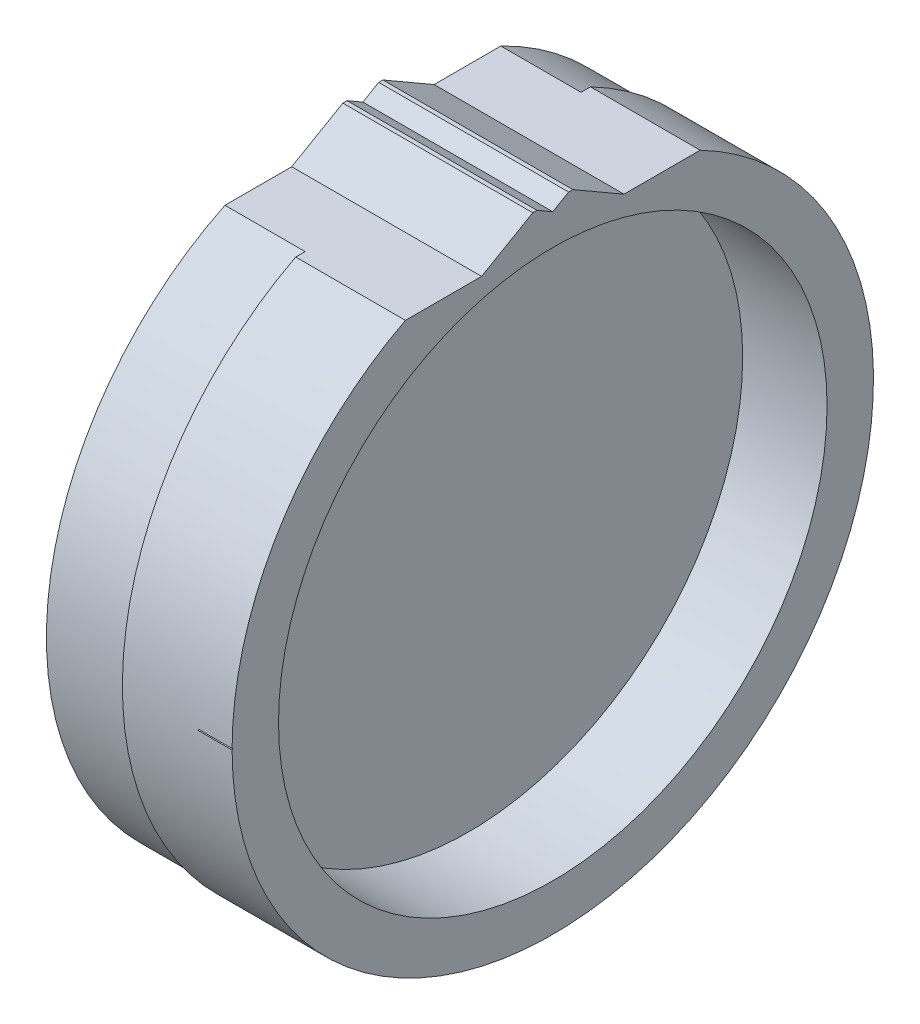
ISO-10303-21;
HEADER;
FILE_DESCRIPTION(('STEP AP214'),'2;1');
FILE_NAME('part.step','',(''),(''),'','','');
FILE_SCHEMA(('AUTOMOTIVE_DESIGN { 1 0 10303 214 1 1 1 1 }'));
ENDSEC;
DATA;
#1=APPLICATION_CONTEXT('core data for automotive mechanical design processes');
#2=APPLICATION_PROTOCOL_DEFINITION('international standard','automotive_design',2000,#1);
#3=PRODUCT_CONTEXT('',#1,'mechanical');
#4=PRODUCT('Part','Part','',(#3));
#5=PRODUCT_RELATED_PRODUCT_CATEGORY('part','',(#4));
#6=PRODUCT_DEFINITION_FORMATION('','',#4);
#7=PRODUCT_DEFINITION_CONTEXT('part definition',#1,'design');
#8=PRODUCT_DEFINITION('design','',#6,#7);
#9=PRODUCT_DEFINITION_SHAPE('','',#8);
#10=(LENGTH_UNIT() NAMED_UNIT(*) SI_UNIT(.MILLI.,.METRE.));
#11=(NAMED_UNIT(*) PLANE_ANGLE_UNIT() SI_UNIT($,.RADIAN.));
#12=(NAMED_UNIT(*) SI_UNIT($,.STERADIAN.) SOLID_ANGLE_UNIT());
#13=UNCERTAINTY_MEASURE_WITH_UNIT(LENGTH_MEASURE(1.E-05),#10,'distance_accuracy_value','');
#14=(GEOMETRIC_REPRESENTATION_CONTEXT(3) GLOBAL_UNCERTAINTY_ASSIGNED_CONTEXT((#13)) GLOBAL_UNIT_ASSIGNED_CONTEXT((#10,
#11,#12)) REPRESENTATION_CONTEXT('',''));
#15=CARTESIAN_POINT('',(0.,0.,0.));
#16=DIRECTION('',(0.,0.,1.));
#17=DIRECTION('',(1.,0.,0.));
#18=AXIS2_PLACEMENT_3D('',#15,#16,#17);
#19=CARTESIAN_POINT('',(-46.,74.5,-25.));
#20=DIRECTION('',(0.,-1.,0.));
#21=DIRECTION('',(0.,0.,-1.));
#22=AXIS2_PLACEMENT_3D('',#19,#20,#21);
#23=PLANE('',#22);
#24=DIRECTION('',(0.,0.,1.));
#25=VECTOR('',#24,1.);
#26=CARTESIAN_POINT('',(-45.,74.5,0.));
#27=LINE('',#26,#25);
#28=CARTESIAN_POINT('',(-45.,74.5,3.75));
#29=VERTEX_POINT('',#28);
#30=CARTESIAN_POINT('',(-45.,74.5,4.75));
#31=VERTEX_POINT('',#30);
#32=EDGE_CURVE('E175',#29,#31,#27,.T.);
#33=ORIENTED_EDGE('',*,*,#32,.T.);
#34=DIRECTION('',(-1.,0.,0.));
#35=VECTOR('',#34,1.);
#36=CARTESIAN_POINT('',(0.001000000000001,74.5,4.75));
#37=LINE('',#36,#35);
#38=CARTESIAN_POINT('',(0.,74.5,4.75));
#39=VERTEX_POINT('',#38);
#40=EDGE_CURVE('E44',#39,#31,#37,.T.);
#41=ORIENTED_EDGE('',*,*,#40,.F.);
#42=DIRECTION('',(0.,0.,-1.));
#43=VECTOR('',#42,1.);
#44=CARTESIAN_POINT('',(0.,74.5,0.));
#45=LINE('',#44,#43);
#46=CARTESIAN_POINT('',(0.,74.5,3.75));
#47=VERTEX_POINT('',#46);
#48=EDGE_CURVE('E171',#39,#47,#45,.T.);
#49=ORIENTED_EDGE('',*,*,#48,.T.);
#50=DIRECTION('',(-1.,0.,0.));
#51=VECTOR('',#50,1.);
#52=CARTESIAN_POINT('',(0.001000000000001,74.5,3.75));
#53=LINE('',#52,#51);
#54=EDGE_CURVE('E464',#47,#29,#53,.T.);
#55=ORIENTED_EDGE('',*,*,#54,.T.);
#56=EDGE_LOOP('',(#33,#41,#49,#55));
#57=FACE_BOUND('',#56,.T.);
#58=ADVANCED_FACE('F17',(#57),#23,.F.);
#59=CARTESIAN_POINT('',(0.,0.,0.));
#60=DIRECTION('',(1.,0.,0.));
#61=DIRECTION('',(0.,0.,-1.));
#62=AXIS2_PLACEMENT_3D('',#59,#60,#61);
#63=CYLINDRICAL_SURFACE('',#62,75.);
#64=DIRECTION('',(1.,0.,0.));
#65=VECTOR('',#64,1.);
#66=CARTESIAN_POINT('',(0.,67.5,-32.6917420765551));
#67=LINE('',#66,#65);
#68=CARTESIAN_POINT('',(-45.,67.5,-32.6917420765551));
#69=VERTEX_POINT('',#68);
#70=CARTESIAN_POINT('',(-26.,67.5,-32.6917420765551));
#71=VERTEX_POINT('',#70);
#72=EDGE_CURVE('E165',#69,#71,#67,.T.);
#73=ORIENTED_EDGE('',*,*,#72,.T.);
#74=CARTESIAN_POINT('',(-26.,0.,0.));
#75=DIRECTION('',(1.,0.,0.));
#76=DIRECTION('',(0.,0.,-1.));
#77=AXIS2_PLACEMENT_3D('',#74,#75,#76);
#78=CIRCLE('',#77,75.);
#79=CARTESIAN_POINT('',(-26.,67.5,32.6917420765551));
#80=VERTEX_POINT('',#79);
#81=EDGE_CURVE('E259',#80,#71,#78,.T.);
#82=ORIENTED_EDGE('',*,*,#81,.F.);
#83=DIRECTION('',(1.,0.,0.));
#84=VECTOR('',#83,1.);
#85=CARTESIAN_POINT('',(0.,67.5,32.6917420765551));
#86=LINE('',#85,#84);
#87=CARTESIAN_POINT('',(-45.,67.5,32.6917420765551));
#88=VERTEX_POINT('',#87);
#89=EDGE_CURVE('E439',#80,#88,#86,.F.);
#90=ORIENTED_EDGE('',*,*,#89,.T.);
#91=CARTESIAN_POINT('',(-45.,0.,0.));
#92=DIRECTION('',(1.,0.,0.));
#93=DIRECTION('',(0.,0.,-1.));
#94=AXIS2_PLACEMENT_3D('',#91,#92,#93);
#95=CIRCLE('',#94,75.);
#96=EDGE_CURVE('E256',#88,#69,#95,.T.);
#97=ORIENTED_EDGE('',*,*,#96,.T.);
#98=EDGE_LOOP('',(#73,#82,#90,#97));
#99=FACE_BOUND('',#98,.T.);
#100=CARTESIAN_POINT('',(-37.,-74.7596147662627,-6.));
#101=CARTESIAN_POINT('',(-37.1682816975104,-74.7596144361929,-6.00000148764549));
#102=CARTESIAN_POINT('',(-37.3365401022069,-74.7601841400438,-5.99291755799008));
#103=CARTESIAN_POINT('',(-37.6719130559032,-74.7624461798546,-5.96463328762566));
#104=CARTESIAN_POINT('',(-37.8390273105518,-74.7641387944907,-5.94342944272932));
#105=CARTESIAN_POINT('',(-38.1710030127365,-74.7686008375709,-5.88703031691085));
#106=CARTESIAN_POINT('',(-38.3358624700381,-74.7713711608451,-5.85182340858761));
#107=CARTESIAN_POINT('',(-38.6620778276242,-74.7779105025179,-5.76765824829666));
#108=CARTESIAN_POINT('',(-38.8234324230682,-74.7816798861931,-5.71869496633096));
#109=CARTESIAN_POINT('',(-39.141280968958,-74.7901053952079,-5.60742739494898));
#110=CARTESIAN_POINT('',(-39.2977793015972,-74.7947606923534,-5.54513555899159));
#111=CARTESIAN_POINT('',(-39.6050236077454,-74.8048298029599,-5.40760490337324));
#112=CARTESIAN_POINT('',(-39.7557674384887,-74.8102438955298,-5.33236131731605));
#113=CARTESIAN_POINT('',(-40.0502920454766,-74.8216722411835,-5.16952771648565));
#114=CARTESIAN_POINT('',(-40.1940768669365,-74.8276861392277,-5.08194499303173));
#115=CARTESIAN_POINT('',(-40.4738199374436,-74.8401489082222,-4.89498600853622));
#116=CARTESIAN_POINT('',(-40.6097752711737,-74.8465979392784,-4.79560539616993));
#117=CARTESIAN_POINT('',(-40.8730759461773,-74.8597581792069,-4.5855958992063));
#118=CARTESIAN_POINT('',(-41.0004059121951,-74.866469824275,-4.47494776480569));
#119=CARTESIAN_POINT('',(-41.2453444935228,-74.8799571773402,-4.24328601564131));
#120=CARTESIAN_POINT('',(-41.3629494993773,-74.8867329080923,-4.12226858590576));
#121=CARTESIAN_POINT('',(-41.5875190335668,-74.9001519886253,-3.87079797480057));
#122=CARTESIAN_POINT('',(-41.6944870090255,-74.9067953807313,-3.74034787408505));
#123=CARTESIAN_POINT('',(-41.897106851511,-74.9197665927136,-3.47084670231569));
#124=CARTESIAN_POINT('',(-41.992754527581,-74.9260942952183,-3.33179247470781));
#125=CARTESIAN_POINT('',(-42.1720950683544,-74.9382582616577,-3.04596831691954));
#126=CARTESIAN_POINT('',(-42.2557763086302,-74.9440940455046,-2.89919107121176));
#127=CARTESIAN_POINT('',(-42.4105042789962,-74.9551038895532,-2.59903213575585));
#128=CARTESIAN_POINT('',(-42.481546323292,-74.9602777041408,-2.44564802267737));
#129=CARTESIAN_POINT('',(-42.6104226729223,-74.9698119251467,-2.1334592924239));
#130=CARTESIAN_POINT('',(-42.6682620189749,-74.9741726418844,-1.97465677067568));
#131=CARTESIAN_POINT('',(-42.7703669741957,-74.9819617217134,-1.65270684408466));
#132=CARTESIAN_POINT('',(-42.8146275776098,-74.9853897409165,-1.48955786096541));
#133=CARTESIAN_POINT('',(-42.9262914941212,-74.9941004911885,-0.996156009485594));
#134=CARTESIAN_POINT('',(-42.9729980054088,-74.9978421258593,-0.660925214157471));
#135=CARTESIAN_POINT('',(-43.0094677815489,-75.0007561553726,0.0124549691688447));
#136=CARTESIAN_POINT('',(-42.9992320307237,-74.9999286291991,0.350604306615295));
#137=CARTESIAN_POINT('',(-42.9222803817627,-74.9938127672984,1.0196302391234));
#138=CARTESIAN_POINT('',(-42.8556937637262,-74.9885346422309,1.35052170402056));
#139=CARTESIAN_POINT('',(-42.6681116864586,-74.9741210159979,1.9964034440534));
#140=CARTESIAN_POINT('',(-42.5471157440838,-74.9649854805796,2.3113935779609));
#141=CARTESIAN_POINT('',(-42.2540104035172,-74.9438679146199,2.91695932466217));
#142=CARTESIAN_POINT('',(-42.0818429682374,-74.9318826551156,3.20750673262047));
#143=CARTESIAN_POINT('',(-41.6913225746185,-74.9064127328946,3.75562727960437));
#144=CARTESIAN_POINT('',(-41.4729687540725,-74.8929280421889,4.01319980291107));
#145=CARTESIAN_POINT('',(-40.9955451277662,-74.8659305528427,4.48881604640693));
#146=CARTESIAN_POINT('',(-40.7363629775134,-74.8524177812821,4.70674701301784));
#147=CARTESIAN_POINT('',(-40.1850317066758,-74.8269251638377,5.09602278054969));
#148=CARTESIAN_POINT('',(-39.892882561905,-74.8149453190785,5.26736754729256));
#149=CARTESIAN_POINT('',(-39.28383254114,-74.7938725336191,5.55860218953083));
#150=CARTESIAN_POINT('',(-38.9669289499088,-74.7847799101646,5.67848641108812));
#151=CARTESIAN_POINT('',(-38.317402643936,-74.7705170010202,5.86331440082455));
#152=CARTESIAN_POINT('',(-37.9847802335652,-74.7653466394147,5.92825923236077));
#153=CARTESIAN_POINT('',(-37.3142443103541,-74.7595257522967,6.00122257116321));
#154=CARTESIAN_POINT('',(-36.9763480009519,-74.7588627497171,6.00939822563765));
#155=CARTESIAN_POINT('',(-36.3039895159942,-74.7620987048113,5.96900258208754));
#156=CARTESIAN_POINT('',(-35.9695273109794,-74.7659976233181,5.92043177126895));
#157=CARTESIAN_POINT('',(-35.3139811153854,-74.7779067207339,5.76805289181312));
#158=CARTESIAN_POINT('',(-34.992880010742,-74.7859114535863,5.66431798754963));
#159=CARTESIAN_POINT('',(-34.372641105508,-74.8051256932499,5.40462981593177));
#160=CARTESIAN_POINT('',(-34.0735036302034,-74.8163352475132,5.24867577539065));
#161=CARTESIAN_POINT('',(-33.5049637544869,-74.8407263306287,4.88857826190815));
#162=CARTESIAN_POINT('',(-33.2356279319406,-74.85391212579,4.68432996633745));
#163=CARTESIAN_POINT('',(-32.7350094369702,-74.880755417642,4.23359219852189));
#164=CARTESIAN_POINT('',(-32.5037273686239,-74.8944129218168,3.98710205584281));
#165=CARTESIAN_POINT('',(-32.0852457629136,-74.9206978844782,3.45820343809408));
#166=CARTESIAN_POINT('',(-31.8981482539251,-74.9333229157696,3.1757141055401));
#167=CARTESIAN_POINT('',(-31.5740482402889,-74.9560851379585,2.58322271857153));
#168=CARTESIAN_POINT('',(-31.4370452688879,-74.9662223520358,2.27322092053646));
#169=CARTESIAN_POINT('',(-31.2171924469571,-74.9828567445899,1.63493442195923));
#170=CARTESIAN_POINT('',(-31.1342792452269,-74.9893581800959,1.30667160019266));
#171=CARTESIAN_POINT('',(-31.0247767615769,-74.9980011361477,0.640645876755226));
#172=CARTESIAN_POINT('',(-30.9981865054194,-75.0001427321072,0.302883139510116));
#173=CARTESIAN_POINT('',(-31.0010527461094,-74.9999169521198,-0.202703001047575));
#174=CARTESIAN_POINT('',(-31.0091081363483,-74.9992706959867,-0.370910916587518));
#175=CARTESIAN_POINT('',(-31.039314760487,-74.9968632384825,-0.706031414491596));
#176=CARTESIAN_POINT('',(-31.0614607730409,-74.9951024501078,-0.872944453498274));
#177=CARTESIAN_POINT('',(-31.1197055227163,-74.9905129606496,-1.20435424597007));
#178=CARTESIAN_POINT('',(-31.1558093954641,-74.9876838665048,-1.36885008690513));
#179=CARTESIAN_POINT('',(-31.2416898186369,-74.9810396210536,-1.69415097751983));
#180=CARTESIAN_POINT('',(-31.2914613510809,-74.9772248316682,-1.85495735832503));
#181=CARTESIAN_POINT('',(-31.4043438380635,-74.9687148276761,-2.17185027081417));
#182=CARTESIAN_POINT('',(-31.4674590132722,-74.9640193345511,-2.32793529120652));
#183=CARTESIAN_POINT('',(-31.6065418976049,-74.9538830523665,-2.63417554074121));
#184=CARTESIAN_POINT('',(-31.6825048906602,-74.9484425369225,-2.78433292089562));
#185=CARTESIAN_POINT('',(-31.8467876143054,-74.9369660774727,-3.07777289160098));
#186=CARTESIAN_POINT('',(-31.9351116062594,-74.9309299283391,-3.22105308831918));
#187=CARTESIAN_POINT('',(-32.1234362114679,-74.9184360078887,-3.49962608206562));
#188=CARTESIAN_POINT('',(-32.2234325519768,-74.9119783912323,-3.63492177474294));
#189=CARTESIAN_POINT('',(-32.4347432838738,-74.8988011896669,-3.89703159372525));
#190=CARTESIAN_POINT('',(-32.5460910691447,-74.8920808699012,-4.0238187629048));
#191=CARTESIAN_POINT('',(-32.7790215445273,-74.8785893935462,-4.26752183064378));
#192=CARTESIAN_POINT('',(-32.900600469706,-74.8718182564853,-4.3844413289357));
#193=CARTESIAN_POINT('',(-33.1532490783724,-74.8584101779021,-4.60770485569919));
#194=CARTESIAN_POINT('',(-33.2843245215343,-74.8517733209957,-4.71404237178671));
#195=CARTESIAN_POINT('',(-33.5549257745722,-74.838828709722,-4.91527035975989));
#196=CARTESIAN_POINT('',(-33.6944484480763,-74.8325208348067,-5.01016504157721));
#197=CARTESIAN_POINT('',(-33.9813102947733,-74.8203977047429,-5.1880687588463));
#198=CARTESIAN_POINT('',(-34.1286654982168,-74.8145835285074,-5.27105202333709));
#199=CARTESIAN_POINT('',(-34.4298168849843,-74.803630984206,-5.42426873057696));
#200=CARTESIAN_POINT('',(-34.5836106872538,-74.7984923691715,-5.49450683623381));
#201=CARTESIAN_POINT('',(-34.8964682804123,-74.7890394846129,-5.6217116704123));
#202=CARTESIAN_POINT('',(-35.0555274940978,-74.7847245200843,-5.67868959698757));
#203=CARTESIAN_POINT('',(-35.3778512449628,-74.7770379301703,-5.77902451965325));
#204=CARTESIAN_POINT('',(-35.5411147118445,-74.7736660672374,-5.82238494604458));
#205=CARTESIAN_POINT('',(-35.918170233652,-74.7671411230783,-5.90566315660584));
#206=CARTESIAN_POINT('',(-36.1329941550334,-74.7643296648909,-5.94100693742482));
#207=CARTESIAN_POINT('',(-36.5652250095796,-74.7605667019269,-5.98817436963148));
#208=CARTESIAN_POINT('',(-36.7826319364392,-74.7596151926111,-5.99999807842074));
#209=CARTESIAN_POINT('',(-37.,-74.7596147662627,-6.));
#210=B_SPLINE_CURVE_WITH_KNOTS('',3,(#100,#101,#102,#103,#104,#105,#106,#107,#108,#109,#110,
#111,#112,#113,#114,#115,#116,#117,#118,#119,#120,#121,#122,#123,#124,#125,#126,#127,#128,#129,
#130,#131,#132,#133,#134,#135,#136,#137,#138,#139,#140,#141,#142,#143,#144,#145,#146,#147,#148,
#149,#150,#151,#152,#153,#154,#155,#156,#157,#158,#159,#160,#161,#162,#163,#164,#165,#166,#167,
#168,#169,#170,#171,#172,#173,#174,#175,#176,#177,#178,#179,#180,#181,#182,#183,#184,#185,#186,
#187,#188,#189,#190,#191,#192,#193,#194,#195,#196,#197,#198,#199,#200,#201,#202,#203,#204,#205,
#206,#207,#208,#209),.UNSPECIFIED.,.T.,.F.,(4,2,2,2,2,2,2,2,2,2,2,2,2,2,2,2,2,2,2,2,2,2,2,2,2,2,
2,2,2,2,2,2,2,2,2,2,2,2,2,2,2,2,2,2,2,2,2,2,2,2,2,2,2,2,4),(0.,0.504655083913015,
1.00943545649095,1.51463584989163,2.02002121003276,2.52493641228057,3.03003782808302,
3.53484201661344,4.03983297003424,4.54570162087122,5.05175719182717,5.55764822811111,
6.06372597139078,6.57029203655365,7.0770455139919,7.58360519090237,8.09035138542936,
9.10056555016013,10.1107622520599,11.1186476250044,12.1265419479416,13.1355837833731,
14.1446444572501,15.1565318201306,16.1684199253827,17.1804191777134,18.192398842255,
19.2015760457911,20.2107445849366,21.2185779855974,22.2264263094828,23.2364825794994,
24.2465548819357,25.2589372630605,26.2713102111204,27.2824953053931,28.2936629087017,
28.7983777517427,29.3029056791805,29.8076194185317,30.312148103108,30.8168366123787,
31.321340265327,31.826018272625,32.330512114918,32.8365354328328,33.3423733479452,
33.8485206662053,34.3544811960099,34.8615204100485,35.3683737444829,35.8747974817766,
36.3810935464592,37.0329538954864,37.6848126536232),.UNSPECIFIED.);
#211=CARTESIAN_POINT('',(-37.,-74.7596147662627,-6.));
#212=VERTEX_POINT('',#211);
#213=EDGE_CURVE('E11',#212,#212,#210,.T.);
#214=ORIENTED_EDGE('',*,*,#213,.T.);
#215=EDGE_LOOP('',(#214));
#216=FACE_BOUND('',#215,.T.);
#217=ADVANCED_FACE('F285',(#99,#216),#63,.T.);
#218=CARTESIAN_POINT('',(-20.,0.,0.));
#219=DIRECTION('',(1.,0.,0.));
#220=DIRECTION('',(0.,0.,-1.));
#221=AXIS2_PLACEMENT_3D('',#218,#219,#220);
#222=PLANE('',#221);
#223=CARTESIAN_POINT('',(-20.,0.,0.));
#224=DIRECTION('',(1.,0.,0.));
#225=DIRECTION('',(0.,0.,-1.));
#226=AXIS2_PLACEMENT_3D('',#223,#224,#225);
#227=CIRCLE('',#226,65.);
#228=CARTESIAN_POINT('',(-20.,0.,-65.));
#229=VERTEX_POINT('',#228);
#230=EDGE_CURVE('E29',#229,#229,#227,.T.);
#231=ORIENTED_EDGE('',*,*,#230,.T.);
#232=EDGE_LOOP('',(#231));
#233=FACE_BOUND('',#232,.T.);
#234=ADVANCED_FACE('F19',(#233),#222,.T.);
#235=CARTESIAN_POINT('',(0.,0.,0.));
#236=DIRECTION('',(1.,0.,0.));
#237=DIRECTION('',(0.,0.,-1.));
#238=AXIS2_PLACEMENT_3D('',#235,#236,#237);
#239=CYLINDRICAL_SURFACE('',#238,65.);
#240=CARTESIAN_POINT('',(0.,0.,0.));
#241=DIRECTION('',(1.,0.,0.));
#242=DIRECTION('',(0.,0.,-1.));
#243=AXIS2_PLACEMENT_3D('',#240,#241,#242);
#244=CIRCLE('',#243,65.);
#245=CARTESIAN_POINT('',(0.,0.,-65.));
#246=VERTEX_POINT('',#245);
#247=EDGE_CURVE('E268',#246,#246,#244,.T.);
#248=ORIENTED_EDGE('',*,*,#247,.T.);
#249=EDGE_LOOP('',(#248));
#250=FACE_BOUND('',#249,.T.);
#251=ORIENTED_EDGE('',*,*,#230,.F.);
#252=EDGE_LOOP('',(#251));
#253=FACE_BOUND('',#252,.T.);
#254=ADVANCED_FACE('F274',(#250,#253),#239,.F.);
#255=CARTESIAN_POINT('',(0.,65.,0.));
#256=DIRECTION('',(1.,0.,0.));
#257=DIRECTION('',(0.,0.,-1.));
#258=AXIS2_PLACEMENT_3D('',#255,#256,#257);
#259=PLANE('',#258);
#260=DIRECTION('',(0.,0.5,0.866025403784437));
#261=VECTOR('',#260,1.);
#262=CARTESIAN_POINT('',(0.,74.5,-4.75));
#263=LINE('',#262,#261);
#264=CARTESIAN_POINT('',(0.,67.5,-16.874355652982));
#265=VERTEX_POINT('',#264);
#266=CARTESIAN_POINT('',(0.,74.5,-4.75));
#267=VERTEX_POINT('',#266);
#268=EDGE_CURVE('E147',#265,#267,#263,.T.);
#269=ORIENTED_EDGE('',*,*,#268,.T.);
#270=CARTESIAN_POINT('',(0.,74.5,-3.75));
#271=VERTEX_POINT('',#270);
#272=EDGE_CURVE('E161',#271,#267,#45,.T.);
#273=ORIENTED_EDGE('',*,*,#272,.F.);
#274=DIRECTION('',(0.,-0.5,0.866025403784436));
#275=VECTOR('',#274,1.);
#276=CARTESIAN_POINT('',(0.,74.5,-3.75));
#277=LINE('',#276,#275);
#278=CARTESIAN_POINT('',(0.,72.3349364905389,0.));
#279=VERTEX_POINT('',#278);
#280=EDGE_CURVE('E467',#271,#279,#277,.T.);
#281=ORIENTED_EDGE('',*,*,#280,.T.);
#282=DIRECTION('',(0.,0.5,0.86602540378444));
#283=VECTOR('',#282,1.);
#284=CARTESIAN_POINT('',(0.,72.3349364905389,0.));
#285=LINE('',#284,#283);
#286=EDGE_CURVE('E456',#279,#47,#285,.T.);
#287=ORIENTED_EDGE('',*,*,#286,.T.);
#288=ORIENTED_EDGE('',*,*,#48,.F.);
#289=DIRECTION('',(0.,-0.5,0.866025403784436));
#290=VECTOR('',#289,1.);
#291=CARTESIAN_POINT('',(0.,74.5,4.75));
#292=LINE('',#291,#290);
#293=CARTESIAN_POINT('',(0.,67.5,16.874355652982));
#294=VERTEX_POINT('',#293);
#295=EDGE_CURVE('E435',#39,#294,#292,.T.);
#296=ORIENTED_EDGE('',*,*,#295,.T.);
#297=DIRECTION('',(0.,0.,1.));
#298=VECTOR('',#297,1.);
#299=CARTESIAN_POINT('',(0.,67.5,16.874355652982));
#300=LINE('',#299,#298);
#301=CARTESIAN_POINT('',(0.,67.5,34.9249194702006));
#302=VERTEX_POINT('',#301);
#303=EDGE_CURVE('E433',#294,#302,#300,.T.);
#304=ORIENTED_EDGE('',*,*,#303,.T.);
#305=CARTESIAN_POINT('',(0.,0.,0.));
#306=DIRECTION('',(1.,0.,0.));
#307=DIRECTION('',(0.,0.,-1.));
#308=AXIS2_PLACEMENT_3D('',#305,#306,#307);
#309=CIRCLE('',#308,76.);
#310=CARTESIAN_POINT('',(0.,0.15,75.9998519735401));
#311=VERTEX_POINT('',#310);
#312=EDGE_CURVE('E265',#302,#311,#309,.T.);
#313=ORIENTED_EDGE('',*,*,#312,.T.);
#314=DIRECTION('',(0.,0.499999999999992,0.866025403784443));
#315=VECTOR('',#314,1.);
#316=CARTESIAN_POINT('',(0.,0.15,75.9998519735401));
#317=LINE('',#316,#315);
#318=CARTESIAN_POINT('',(0.,0.,75.7400443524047));
#319=VERTEX_POINT('',#318);
#320=EDGE_CURVE('E181',#319,#311,#317,.T.);
#321=ORIENTED_EDGE('',*,*,#320,.F.);
#322=DIRECTION('',(0.,0.499999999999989,-0.866025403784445));
#323=VECTOR('',#322,1.);
#324=CARTESIAN_POINT('',(0.,0.,75.7400443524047));
#325=LINE('',#324,#323);
#326=CARTESIAN_POINT('',(0.,-0.15,75.9998519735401));
#327=VERTEX_POINT('',#326);
#328=EDGE_CURVE('E174',#327,#319,#325,.T.);
#329=ORIENTED_EDGE('',*,*,#328,.F.);
#330=CARTESIAN_POINT('',(0.,67.5,-34.9249194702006));
#331=VERTEX_POINT('',#330);
#332=EDGE_CURVE('E266',#327,#331,#309,.T.);
#333=ORIENTED_EDGE('',*,*,#332,.T.);
#334=DIRECTION('',(0.,0.,1.));
#335=VECTOR('',#334,1.);
#336=CARTESIAN_POINT('',(0.,67.5,-16.874355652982));
#337=LINE('',#336,#335);
#338=EDGE_CURVE('E163',#331,#265,#337,.T.);
#339=ORIENTED_EDGE('',*,*,#338,.T.);
#340=EDGE_LOOP('',(#269,#273,#281,#287,#288,#296,#304,#313,#321,#329,#333,#339));
#341=FACE_BOUND('',#340,.T.);
#342=ORIENTED_EDGE('',*,*,#247,.F.);
#343=EDGE_LOOP('',(#342));
#344=FACE_BOUND('',#343,.T.);
#345=ADVANCED_FACE('F158',(#341,#344),#259,.T.);
#346=CARTESIAN_POINT('',(0.,0.,0.));
#347=DIRECTION('',(1.,0.,0.));
#348=DIRECTION('',(0.,0.,-1.));
#349=AXIS2_PLACEMENT_3D('',#346,#347,#348);
#350=CYLINDRICAL_SURFACE('',#349,76.);
#351=DIRECTION('',(-1.,0.,0.));
#352=VECTOR('',#351,1.);
#353=CARTESIAN_POINT('',(0.001000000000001,67.5,-34.9249194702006));
#354=LINE('',#353,#352);
#355=CARTESIAN_POINT('',(-26.,67.5,-34.9249194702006));
#356=VERTEX_POINT('',#355);
#357=EDGE_CURVE('E417',#331,#356,#354,.T.);
#358=ORIENTED_EDGE('',*,*,#357,.F.);
#359=ORIENTED_EDGE('',*,*,#332,.F.);
#360=DIRECTION('',(1.,0.,0.));
#361=VECTOR('',#360,1.);
#362=CARTESIAN_POINT('',(-8.,-0.15,75.9998519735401));
#363=LINE('',#362,#361);
#364=CARTESIAN_POINT('',(-8.,-0.15,75.9998519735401));
#365=VERTEX_POINT('',#364);
#366=EDGE_CURVE('E192',#365,#327,#363,.T.);
#367=ORIENTED_EDGE('',*,*,#366,.F.);
#368=CARTESIAN_POINT('',(-8.,0.,0.));
#369=DIRECTION('',(1.,0.,0.));
#370=DIRECTION('',(0.,0.,-1.));
#371=AXIS2_PLACEMENT_3D('',#368,#369,#370);
#372=CIRCLE('',#371,76.);
#373=CARTESIAN_POINT('',(-8.,0.15,75.9998519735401));
#374=VERTEX_POINT('',#373);
#375=EDGE_CURVE('E184',#374,#365,#372,.T.);
#376=ORIENTED_EDGE('',*,*,#375,.F.);
#377=DIRECTION('',(1.,0.,0.));
#378=VECTOR('',#377,1.);
#379=CARTESIAN_POINT('',(-8.,0.15,75.9998519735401));
#380=LINE('',#379,#378);
#381=EDGE_CURVE('E193',#374,#311,#380,.T.);
#382=ORIENTED_EDGE('',*,*,#381,.T.);
#383=ORIENTED_EDGE('',*,*,#312,.F.);
#384=DIRECTION('',(-1.,0.,0.));
#385=VECTOR('',#384,1.);
#386=CARTESIAN_POINT('',(0.001000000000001,67.5,34.9249194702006));
#387=LINE('',#386,#385);
#388=CARTESIAN_POINT('',(-26.,67.5,34.9249194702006));
#389=VERTEX_POINT('',#388);
#390=EDGE_CURVE('E430',#302,#389,#387,.T.);
#391=ORIENTED_EDGE('',*,*,#390,.T.);
#392=CARTESIAN_POINT('',(-26.,0.,0.));
#393=DIRECTION('',(1.,0.,0.));
#394=DIRECTION('',(0.,0.,-1.));
#395=AXIS2_PLACEMENT_3D('',#392,#393,#394);
#396=CIRCLE('',#395,76.);
#397=EDGE_CURVE('E262',#389,#356,#396,.T.);
#398=ORIENTED_EDGE('',*,*,#397,.T.);
#399=EDGE_LOOP('',(#358,#359,#367,#376,#382,#383,#391,#398));
#400=FACE_BOUND('',#399,.T.);
#401=ADVANCED_FACE('F283',(#400),#350,.T.);
#402=CARTESIAN_POINT('',(-26.,76.,0.));
#403=DIRECTION('',(-1.,0.,0.));
#404=DIRECTION('',(0.,0.,1.));
#405=AXIS2_PLACEMENT_3D('',#402,#403,#404);
#406=PLANE('',#405);
#407=DIRECTION('',(0.,0.,-1.));
#408=VECTOR('',#407,1.);
#409=CARTESIAN_POINT('',(-26.,67.5,-16.874355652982));
#410=LINE('',#409,#408);
#411=EDGE_CURVE('E152',#71,#356,#410,.T.);
#412=ORIENTED_EDGE('',*,*,#411,.T.);
#413=ORIENTED_EDGE('',*,*,#397,.F.);
#414=DIRECTION('',(0.,0.,-1.));
#415=VECTOR('',#414,1.);
#416=CARTESIAN_POINT('',(-26.,67.5,16.874355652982));
#417=LINE('',#416,#415);
#418=EDGE_CURVE('E453',#389,#80,#417,.T.);
#419=ORIENTED_EDGE('',*,*,#418,.T.);
#420=ORIENTED_EDGE('',*,*,#81,.T.);
#421=EDGE_LOOP('',(#412,#413,#419,#420));
#422=FACE_BOUND('',#421,.T.);
#423=ADVANCED_FACE('F403',(#422),#406,.T.);
#424=CARTESIAN_POINT('',(-45.,75.,0.));
#425=DIRECTION('',(-1.,0.,0.));
#426=DIRECTION('',(0.,0.,1.));
#427=AXIS2_PLACEMENT_3D('',#424,#425,#426);
#428=PLANE('',#427);
#429=DIRECTION('',(0.,0.5,0.866025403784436));
#430=VECTOR('',#429,1.);
#431=CARTESIAN_POINT('',(-45.,74.5,-4.75));
#432=LINE('',#431,#430);
#433=CARTESIAN_POINT('',(-45.,67.5,-16.874355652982));
#434=VERTEX_POINT('',#433);
#435=CARTESIAN_POINT('',(-45.,74.5,-4.75));
#436=VERTEX_POINT('',#435);
#437=EDGE_CURVE('E36',#434,#436,#432,.T.);
#438=ORIENTED_EDGE('',*,*,#437,.F.);
#439=DIRECTION('',(0.,0.,1.));
#440=VECTOR('',#439,1.);
#441=CARTESIAN_POINT('',(-45.,67.5,-16.874355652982));
#442=LINE('',#441,#440);
#443=EDGE_CURVE('E164',#69,#434,#442,.T.);
#444=ORIENTED_EDGE('',*,*,#443,.F.);
#445=ORIENTED_EDGE('',*,*,#96,.F.);
#446=DIRECTION('',(0.,0.,1.));
#447=VECTOR('',#446,1.);
#448=CARTESIAN_POINT('',(-45.,67.5,16.874355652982));
#449=LINE('',#448,#447);
#450=CARTESIAN_POINT('',(-45.,67.5,16.874355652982));
#451=VERTEX_POINT('',#450);
#452=EDGE_CURVE('E441',#451,#88,#449,.T.);
#453=ORIENTED_EDGE('',*,*,#452,.F.);
#454=DIRECTION('',(0.,-0.5,0.866025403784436));
#455=VECTOR('',#454,1.);
#456=CARTESIAN_POINT('',(-45.,74.5,4.75));
#457=LINE('',#456,#455);
#458=EDGE_CURVE('E438',#31,#451,#457,.T.);
#459=ORIENTED_EDGE('',*,*,#458,.F.);
#460=ORIENTED_EDGE('',*,*,#32,.F.);
#461=DIRECTION('',(0.,0.5,0.86602540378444));
#462=VECTOR('',#461,1.);
#463=CARTESIAN_POINT('',(-45.,72.3349364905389,0.));
#464=LINE('',#463,#462);
#465=CARTESIAN_POINT('',(-45.,72.3349364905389,0.));
#466=VERTEX_POINT('',#465);
#467=EDGE_CURVE('E462',#466,#29,#464,.T.);
#468=ORIENTED_EDGE('',*,*,#467,.F.);
#469=DIRECTION('',(0.,-0.5,0.866025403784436));
#470=VECTOR('',#469,1.);
#471=CARTESIAN_POINT('',(-45.,74.5,-3.75));
#472=LINE('',#471,#470);
#473=CARTESIAN_POINT('',(-45.,74.5,-3.75));
#474=VERTEX_POINT('',#473);
#475=EDGE_CURVE('E459',#474,#466,#472,.T.);
#476=ORIENTED_EDGE('',*,*,#475,.F.);
#477=EDGE_CURVE('E172',#436,#474,#27,.T.);
#478=ORIENTED_EDGE('',*,*,#477,.F.);
#479=EDGE_LOOP('',(#438,#444,#445,#453,#459,#460,#468,#476,#478));
#480=FACE_BOUND('',#479,.T.);
#481=CARTESIAN_POINT('',(-45.,54.1265877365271,-31.2500000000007));
#482=DIRECTION('',(-1.,0.,0.));
#483=DIRECTION('',(0.,0.,1.));
#484=AXIS2_PLACEMENT_3D('',#481,#482,#483);
#485=CIRCLE('',#484,4.25);
#486=CARTESIAN_POINT('',(-45.,54.1265877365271,-27.0000000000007));
#487=VERTEX_POINT('',#486);
#488=EDGE_CURVE('E211',#487,#487,#485,.T.);
#489=ORIENTED_EDGE('',*,*,#488,.F.);
#490=EDGE_LOOP('',(#489));
#491=FACE_BOUND('',#490,.T.);
#492=CARTESIAN_POINT('',(-45.,54.1265877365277,31.2499999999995));
#493=DIRECTION('',(-1.,0.,0.));
#494=DIRECTION('',(0.,0.,1.));
#495=AXIS2_PLACEMENT_3D('',#492,#493,#494);
#496=CIRCLE('',#495,4.25);
#497=CARTESIAN_POINT('',(-45.,54.1265877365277,35.4999999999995));
#498=VERTEX_POINT('',#497);
#499=EDGE_CURVE('E217',#498,#498,#496,.T.);
#500=ORIENTED_EDGE('',*,*,#499,.F.);
#501=EDGE_LOOP('',(#500));
#502=FACE_BOUND('',#501,.T.);
#503=CARTESIAN_POINT('',(-45.,4.36435420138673E-13,62.5));
#504=DIRECTION('',(-1.,0.,0.));
#505=DIRECTION('',(0.,0.,1.));
#506=AXIS2_PLACEMENT_3D('',#503,#504,#505);
#507=CIRCLE('',#506,4.25);
#508=CARTESIAN_POINT('',(-45.,4.36435420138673E-13,66.75));
#509=VERTEX_POINT('',#508);
#510=EDGE_CURVE('E223',#509,#509,#507,.T.);
#511=ORIENTED_EDGE('',*,*,#510,.F.);
#512=EDGE_LOOP('',(#511));
#513=FACE_BOUND('',#512,.T.);
#514=CARTESIAN_POINT('',(-45.,-54.1265877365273,31.25));
#515=DIRECTION('',(-1.,0.,0.));
#516=DIRECTION('',(0.,0.,1.));
#517=AXIS2_PLACEMENT_3D('',#514,#515,#516);
#518=CIRCLE('',#517,4.25);
#519=CARTESIAN_POINT('',(-45.,-54.1265877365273,35.5));
#520=VERTEX_POINT('',#519);
#521=EDGE_CURVE('E229',#520,#520,#518,.T.);
#522=ORIENTED_EDGE('',*,*,#521,.F.);
#523=EDGE_LOOP('',(#522));
#524=FACE_BOUND('',#523,.T.);
#525=CARTESIAN_POINT('',(-45.,-54.1265877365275,-31.25));
#526=DIRECTION('',(-1.,0.,0.));
#527=DIRECTION('',(0.,0.,1.));
#528=AXIS2_PLACEMENT_3D('',#525,#526,#527);
#529=CIRCLE('',#528,4.25);
#530=CARTESIAN_POINT('',(-45.,-54.1265877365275,-27.));
#531=VERTEX_POINT('',#530);
#532=EDGE_CURVE('E235',#531,#531,#529,.T.);
#533=ORIENTED_EDGE('',*,*,#532,.F.);
#534=EDGE_LOOP('',(#533));
#535=FACE_BOUND('',#534,.T.);
#536=CARTESIAN_POINT('',(-45.,0.,-62.5));
#537=DIRECTION('',(-1.,0.,0.));
#538=DIRECTION('',(0.,0.,1.));
#539=AXIS2_PLACEMENT_3D('',#536,#537,#538);
#540=CIRCLE('',#539,4.25);
#541=CARTESIAN_POINT('',(-45.,0.,-58.25));
#542=VERTEX_POINT('',#541);
#543=EDGE_CURVE('E241',#542,#542,#540,.T.);
#544=ORIENTED_EDGE('',*,*,#543,.F.);
#545=EDGE_LOOP('',(#544));
#546=FACE_BOUND('',#545,.T.);
#547=CARTESIAN_POINT('',(-45.,62.5,0.));
#548=DIRECTION('',(-1.,0.,0.));
#549=DIRECTION('',(0.,0.,1.));
#550=AXIS2_PLACEMENT_3D('',#547,#548,#549);
#551=CIRCLE('',#550,5.);
#552=CARTESIAN_POINT('',(-45.,62.5,5.));
#553=VERTEX_POINT('',#552);
#554=EDGE_CURVE('E244',#553,#553,#551,.T.);
#555=ORIENTED_EDGE('',*,*,#554,.F.);
#556=EDGE_LOOP('',(#555));
#557=FACE_BOUND('',#556,.T.);
#558=CARTESIAN_POINT('',(-45.,0.,0.));
#559=DIRECTION('',(1.,0.,0.));
#560=DIRECTION('',(0.,0.,-1.));
#561=AXIS2_PLACEMENT_3D('',#558,#559,#560);
#562=CIRCLE('',#561,40.);
#563=CARTESIAN_POINT('',(-45.,0.,-40.));
#564=VERTEX_POINT('',#563);
#565=EDGE_CURVE('E253',#564,#564,#562,.T.);
#566=ORIENTED_EDGE('',*,*,#565,.T.);
#567=EDGE_LOOP('',(#566));
#568=FACE_BOUND('',#567,.T.);
#569=ADVANCED_FACE('F400',(#480,#491,#502,#513,#524,#535,#546,#557,#568),#428,.T.);
#570=CARTESIAN_POINT('',(0.,0.,0.));
#571=DIRECTION('',(1.,0.,0.));
#572=DIRECTION('',(0.,0.,-1.));
#573=AXIS2_PLACEMENT_3D('',#570,#571,#572);
#574=CYLINDRICAL_SURFACE('',#573,40.);
#575=CARTESIAN_POINT('',(-36.5,0.,0.));
#576=DIRECTION('',(1.,0.,0.));
#577=DIRECTION('',(0.,0.,-1.));
#578=AXIS2_PLACEMENT_3D('',#575,#576,#577);
#579=CIRCLE('',#578,40.);
#580=CARTESIAN_POINT('',(-36.5,0.,-40.));
#581=VERTEX_POINT('',#580);
#582=EDGE_CURVE('E250',#581,#581,#579,.T.);
#583=ORIENTED_EDGE('',*,*,#582,.T.);
#584=EDGE_LOOP('',(#583));
#585=FACE_BOUND('',#584,.T.);
#586=ORIENTED_EDGE('',*,*,#565,.F.);
#587=EDGE_LOOP('',(#586));
#588=FACE_BOUND('',#587,.T.);
#589=ADVANCED_FACE('F396',(#585,#588),#574,.F.);
#590=CARTESIAN_POINT('',(-36.5,40.,0.));
#591=DIRECTION('',(-1.,0.,0.));
#592=DIRECTION('',(0.,0.,1.));
#593=AXIS2_PLACEMENT_3D('',#590,#591,#592);
#594=PLANE('',#593);
#595=ORIENTED_EDGE('',*,*,#582,.F.);
#596=EDGE_LOOP('',(#595));
#597=FACE_BOUND('',#596,.T.);
#598=ADVANCED_FACE('F392',(#597),#594,.T.);
#599=CARTESIAN_POINT('',(-30.,62.5,0.));
#600=DIRECTION('',(-1.,0.,0.));
#601=DIRECTION('',(0.,0.,1.));
#602=AXIS2_PLACEMENT_3D('',#599,#600,#601);
#603=CONICAL_SURFACE('',#602,5.,1.02974425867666);
#604=CARTESIAN_POINT('',(-26.9956969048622,62.5,0.));
#605=VERTEX_POINT('',#604);
#606=VERTEX_LOOP('',#605);
#607=FACE_BOUND('',#606,.T.);
#608=CARTESIAN_POINT('',(-30.,62.5,0.));
#609=DIRECTION('',(-1.,0.,0.));
#610=DIRECTION('',(0.,0.,1.));
#611=AXIS2_PLACEMENT_3D('',#608,#609,#610);
#612=CIRCLE('',#611,5.);
#613=CARTESIAN_POINT('',(-30.,62.5,5.));
#614=VERTEX_POINT('',#613);
#615=EDGE_CURVE('E247',#614,#614,#612,.T.);
#616=ORIENTED_EDGE('',*,*,#615,.T.);
#617=EDGE_LOOP('',(#616));
#618=FACE_BOUND('',#617,.T.);
#619=ADVANCED_FACE('F388',(#607,#618),#603,.F.);
#620=CARTESIAN_POINT('',(-45.,62.5,0.));
#621=DIRECTION('',(-1.,0.,0.));
#622=DIRECTION('',(0.,0.,1.));
#623=AXIS2_PLACEMENT_3D('',#620,#621,#622);
#624=CYLINDRICAL_SURFACE('',#623,5.);
#625=ORIENTED_EDGE('',*,*,#615,.F.);
#626=EDGE_LOOP('',(#625));
#627=FACE_BOUND('',#626,.T.);
#628=ORIENTED_EDGE('',*,*,#554,.T.);
#629=EDGE_LOOP('',(#628));
#630=FACE_BOUND('',#629,.T.);
#631=ADVANCED_FACE('F384',(#627,#630),#624,.F.);
#632=CARTESIAN_POINT('',(-45.,0.,-62.5));
#633=DIRECTION('',(-1.,0.,0.));
#634=DIRECTION('',(0.,0.,1.));
#635=AXIS2_PLACEMENT_3D('',#632,#633,#634);
#636=CYLINDRICAL_SURFACE('',#635,4.25);
#637=CARTESIAN_POINT('',(-24.,0.,-62.5));
#638=DIRECTION('',(-1.,0.,0.));
#639=DIRECTION('',(0.,0.,1.));
#640=AXIS2_PLACEMENT_3D('',#637,#638,#639);
#641=CIRCLE('',#640,4.25);
#642=CARTESIAN_POINT('',(-24.,0.,-58.25));
#643=VERTEX_POINT('',#642);
#644=EDGE_CURVE('E238',#643,#643,#641,.T.);
#645=ORIENTED_EDGE('',*,*,#644,.F.);
#646=EDGE_LOOP('',(#645));
#647=FACE_BOUND('',#646,.T.);
#648=ORIENTED_EDGE('',*,*,#543,.T.);
#649=EDGE_LOOP('',(#648));
#650=FACE_BOUND('',#649,.T.);
#651=ADVANCED_FACE('F380',(#647,#650),#636,.F.);
#652=CARTESIAN_POINT('',(-24.,0.,-62.5));
#653=DIRECTION('',(-1.,0.,0.));
#654=DIRECTION('',(0.,0.,1.));
#655=AXIS2_PLACEMENT_3D('',#652,#653,#654);
#656=CONICAL_SURFACE('',#655,4.25,1.02974425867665);
#657=CARTESIAN_POINT('',(-21.4463423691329,0.,-62.5));
#658=VERTEX_POINT('',#657);
#659=VERTEX_LOOP('',#658);
#660=FACE_BOUND('',#659,.T.);
#661=ORIENTED_EDGE('',*,*,#644,.T.);
#662=EDGE_LOOP('',(#661));
#663=FACE_BOUND('',#662,.T.);
#664=ADVANCED_FACE('F376',(#660,#663),#656,.F.);
#665=CARTESIAN_POINT('',(-45.,-54.1265877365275,-31.25));
#666=DIRECTION('',(-1.,0.,0.));
#667=DIRECTION('',(0.,0.,1.));
#668=AXIS2_PLACEMENT_3D('',#665,#666,#667);
#669=CYLINDRICAL_SURFACE('',#668,4.25);
#670=CARTESIAN_POINT('',(-24.,-54.1265877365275,-31.25));
#671=DIRECTION('',(-1.,0.,0.));
#672=DIRECTION('',(0.,0.,1.));
#673=AXIS2_PLACEMENT_3D('',#670,#671,#672);
#674=CIRCLE('',#673,4.25);
#675=CARTESIAN_POINT('',(-24.,-54.1265877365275,-27.));
#676=VERTEX_POINT('',#675);
#677=EDGE_CURVE('E232',#676,#676,#674,.T.);
#678=ORIENTED_EDGE('',*,*,#677,.F.);
#679=EDGE_LOOP('',(#678));
#680=FACE_BOUND('',#679,.T.);
#681=ORIENTED_EDGE('',*,*,#532,.T.);
#682=EDGE_LOOP('',(#681));
#683=FACE_BOUND('',#682,.T.);
#684=ADVANCED_FACE('F372',(#680,#683),#669,.F.);
#685=CARTESIAN_POINT('',(-24.,-54.1265877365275,-31.25));
#686=DIRECTION('',(-1.,0.,0.));
#687=DIRECTION('',(0.,0.,1.));
#688=AXIS2_PLACEMENT_3D('',#685,#686,#687);
#689=CONICAL_SURFACE('',#688,4.25,1.02974425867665);
#690=CARTESIAN_POINT('',(-21.4463423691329,-54.1265877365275,-31.25));
#691=VERTEX_POINT('',#690);
#692=VERTEX_LOOP('',#691);
#693=FACE_BOUND('',#692,.T.);
#694=ORIENTED_EDGE('',*,*,#677,.T.);
#695=EDGE_LOOP('',(#694));
#696=FACE_BOUND('',#695,.T.);
#697=ADVANCED_FACE('F368',(#693,#696),#689,.F.);
#698=CARTESIAN_POINT('',(-45.,-54.1265877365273,31.25));
#699=DIRECTION('',(-1.,0.,0.));
#700=DIRECTION('',(0.,0.,1.));
#701=AXIS2_PLACEMENT_3D('',#698,#699,#700);
#702=CYLINDRICAL_SURFACE('',#701,4.25);
#703=CARTESIAN_POINT('',(-24.,-54.1265877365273,31.25));
#704=DIRECTION('',(-1.,0.,0.));
#705=DIRECTION('',(0.,0.,1.));
#706=AXIS2_PLACEMENT_3D('',#703,#704,#705);
#707=CIRCLE('',#706,4.25);
#708=CARTESIAN_POINT('',(-24.,-54.1265877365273,35.5));
#709=VERTEX_POINT('',#708);
#710=EDGE_CURVE('E226',#709,#709,#707,.T.);
#711=ORIENTED_EDGE('',*,*,#710,.F.);
#712=EDGE_LOOP('',(#711));
#713=FACE_BOUND('',#712,.T.);
#714=ORIENTED_EDGE('',*,*,#521,.T.);
#715=EDGE_LOOP('',(#714));
#716=FACE_BOUND('',#715,.T.);
#717=ADVANCED_FACE('F364',(#713,#716),#702,.F.);
#718=CARTESIAN_POINT('',(-24.,-54.1265877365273,31.25));
#719=DIRECTION('',(-1.,0.,0.));
#720=DIRECTION('',(0.,0.,1.));
#721=AXIS2_PLACEMENT_3D('',#718,#719,#720);
#722=CONICAL_SURFACE('',#721,4.25,1.02974425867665);
#723=CARTESIAN_POINT('',(-21.4463423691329,-54.1265877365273,31.25));
#724=VERTEX_POINT('',#723);
#725=VERTEX_LOOP('',#724);
#726=FACE_BOUND('',#725,.T.);
#727=ORIENTED_EDGE('',*,*,#710,.T.);
#728=EDGE_LOOP('',(#727));
#729=FACE_BOUND('',#728,.T.);
#730=ADVANCED_FACE('F360',(#726,#729),#722,.F.);
#731=CARTESIAN_POINT('',(-45.,4.36435420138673E-13,62.5));
#732=DIRECTION('',(-1.,0.,0.));
#733=DIRECTION('',(0.,0.,1.));
#734=AXIS2_PLACEMENT_3D('',#731,#732,#733);
#735=CYLINDRICAL_SURFACE('',#734,4.25);
#736=CARTESIAN_POINT('',(-24.,4.36435420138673E-13,62.5));
#737=DIRECTION('',(-1.,0.,0.));
#738=DIRECTION('',(0.,0.,1.));
#739=AXIS2_PLACEMENT_3D('',#736,#737,#738);
#740=CIRCLE('',#739,4.25);
#741=CARTESIAN_POINT('',(-24.,4.36435420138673E-13,66.75));
#742=VERTEX_POINT('',#741);
#743=EDGE_CURVE('E220',#742,#742,#740,.T.);
#744=ORIENTED_EDGE('',*,*,#743,.F.);
#745=EDGE_LOOP('',(#744));
#746=FACE_BOUND('',#745,.T.);
#747=ORIENTED_EDGE('',*,*,#510,.T.);
#748=EDGE_LOOP('',(#747));
#749=FACE_BOUND('',#748,.T.);
#750=ADVANCED_FACE('F356',(#746,#749),#735,.F.);
#751=CARTESIAN_POINT('',(-24.,4.36435420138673E-13,62.5));
#752=DIRECTION('',(-1.,0.,0.));
#753=DIRECTION('',(0.,0.,1.));
#754=AXIS2_PLACEMENT_3D('',#751,#752,#753);
#755=CONICAL_SURFACE('',#754,4.25,1.02974425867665);
#756=CARTESIAN_POINT('',(-21.4463423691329,4.3066662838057E-13,62.5));
#757=VERTEX_POINT('',#756);
#758=VERTEX_LOOP('',#757);
#759=FACE_BOUND('',#758,.T.);
#760=ORIENTED_EDGE('',*,*,#743,.T.);
#761=EDGE_LOOP('',(#760));
#762=FACE_BOUND('',#761,.T.);
#763=ADVANCED_FACE('F352',(#759,#762),#755,.F.);
#764=CARTESIAN_POINT('',(-45.,54.1265877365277,31.2499999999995));
#765=DIRECTION('',(-1.,0.,0.));
#766=DIRECTION('',(0.,0.,1.));
#767=AXIS2_PLACEMENT_3D('',#764,#765,#766);
#768=CYLINDRICAL_SURFACE('',#767,4.25);
#769=CARTESIAN_POINT('',(-24.,54.1265877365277,31.2499999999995));
#770=DIRECTION('',(-1.,0.,0.));
#771=DIRECTION('',(0.,0.,1.));
#772=AXIS2_PLACEMENT_3D('',#769,#770,#771);
#773=CIRCLE('',#772,4.25);
#774=CARTESIAN_POINT('',(-24.,54.1265877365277,35.4999999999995));
#775=VERTEX_POINT('',#774);
#776=EDGE_CURVE('E214',#775,#775,#773,.T.);
#777=ORIENTED_EDGE('',*,*,#776,.F.);
#778=EDGE_LOOP('',(#777));
#779=FACE_BOUND('',#778,.T.);
#780=ORIENTED_EDGE('',*,*,#499,.T.);
#781=EDGE_LOOP('',(#780));
#782=FACE_BOUND('',#781,.T.);
#783=ADVANCED_FACE('F348',(#779,#782),#768,.F.);
#784=CARTESIAN_POINT('',(-24.,54.1265877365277,31.2499999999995));
#785=DIRECTION('',(-1.,0.,0.));
#786=DIRECTION('',(0.,0.,1.));
#787=AXIS2_PLACEMENT_3D('',#784,#785,#786);
#788=CONICAL_SURFACE('',#787,4.25,1.02974425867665);
#789=CARTESIAN_POINT('',(-21.4463423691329,54.1265877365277,31.2499999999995));
#790=VERTEX_POINT('',#789);
#791=VERTEX_LOOP('',#790);
#792=FACE_BOUND('',#791,.T.);
#793=ORIENTED_EDGE('',*,*,#776,.T.);
#794=EDGE_LOOP('',(#793));
#795=FACE_BOUND('',#794,.T.);
#796=ADVANCED_FACE('F344',(#792,#795),#788,.F.);
#797=CARTESIAN_POINT('',(-45.,54.1265877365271,-31.2500000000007));
#798=DIRECTION('',(-1.,0.,0.));
#799=DIRECTION('',(0.,0.,1.));
#800=AXIS2_PLACEMENT_3D('',#797,#798,#799);
#801=CYLINDRICAL_SURFACE('',#800,4.25);
#802=CARTESIAN_POINT('',(-24.,54.1265877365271,-31.2500000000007));
#803=DIRECTION('',(-1.,0.,0.));
#804=DIRECTION('',(0.,0.,1.));
#805=AXIS2_PLACEMENT_3D('',#802,#803,#804);
#806=CIRCLE('',#805,4.25);
#807=CARTESIAN_POINT('',(-24.,54.1265877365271,-27.0000000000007));
#808=VERTEX_POINT('',#807);
#809=EDGE_CURVE('E208',#808,#808,#806,.T.);
#810=ORIENTED_EDGE('',*,*,#809,.F.);
#811=EDGE_LOOP('',(#810));
#812=FACE_BOUND('',#811,.T.);
#813=ORIENTED_EDGE('',*,*,#488,.T.);
#814=EDGE_LOOP('',(#813));
#815=FACE_BOUND('',#814,.T.);
#816=ADVANCED_FACE('F340',(#812,#815),#801,.F.);
#817=CARTESIAN_POINT('',(-24.,54.1265877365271,-31.2500000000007));
#818=DIRECTION('',(-1.,0.,0.));
#819=DIRECTION('',(0.,0.,1.));
#820=AXIS2_PLACEMENT_3D('',#817,#818,#819);
#821=CONICAL_SURFACE('',#820,4.25,1.02974425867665);
#822=CARTESIAN_POINT('',(-21.4463423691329,54.126587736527,-31.2500000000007));
#823=VERTEX_POINT('',#822);
#824=VERTEX_LOOP('',#823);
#825=FACE_BOUND('',#824,.T.);
#826=ORIENTED_EDGE('',*,*,#809,.T.);
#827=EDGE_LOOP('',(#826));
#828=FACE_BOUND('',#827,.T.);
#829=ADVANCED_FACE('F336',(#825,#828),#821,.F.);
#830=CARTESIAN_POINT('',(-37.,-88.5,0.));
#831=DIRECTION('',(0.,-1.,0.));
#832=DIRECTION('',(0.,0.,-1.));
#833=AXIS2_PLACEMENT_3D('',#830,#831,#832);
#834=CYLINDRICAL_SURFACE('',#833,6.);
#835=ORIENTED_EDGE('',*,*,#213,.F.);
#836=EDGE_LOOP('',(#835));
#837=FACE_BOUND('',#836,.T.);
#838=CARTESIAN_POINT('',(-37.,-73.,0.));
#839=DIRECTION('',(0.,-1.,0.));
#840=DIRECTION('',(0.,0.,-1.));
#841=AXIS2_PLACEMENT_3D('',#838,#839,#840);
#842=CIRCLE('',#841,6.);
#843=CARTESIAN_POINT('',(-37.,-73.,-6.));
#844=VERTEX_POINT('',#843);
#845=EDGE_CURVE('E196',#844,#844,#842,.T.);
#846=ORIENTED_EDGE('',*,*,#845,.F.);
#847=EDGE_LOOP('',(#846));
#848=FACE_BOUND('',#847,.T.);
#849=ADVANCED_FACE('F331',(#837,#848),#834,.F.);
#850=CARTESIAN_POINT('',(-37.,-54.5566243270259,0.));
#851=DIRECTION('',(0.,-1.,0.));
#852=DIRECTION('',(0.,0.,-1.));
#853=AXIS2_PLACEMENT_3D('',#850,#851,#852);
#854=CONICAL_SURFACE('',#853,0.,1.0471975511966);
#855=CARTESIAN_POINT('',(-37.,-56.,0.));
#856=DIRECTION('',(0.,-1.,0.));
#857=DIRECTION('',(0.,0.,-1.));
#858=AXIS2_PLACEMENT_3D('',#855,#856,#857);
#859=CIRCLE('',#858,2.5);
#860=CARTESIAN_POINT('',(-37.,-56.,-2.5));
#861=VERTEX_POINT('',#860);
#862=EDGE_CURVE('E205',#861,#861,#859,.T.);
#863=ORIENTED_EDGE('',*,*,#862,.T.);
#864=EDGE_LOOP('',(#863));
#865=FACE_BOUND('',#864,.T.);
#866=CARTESIAN_POINT('',(-37.,-54.5566243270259,0.));
#867=VERTEX_POINT('',#866);
#868=VERTEX_LOOP('',#867);
#869=FACE_BOUND('',#868,.T.);
#870=ADVANCED_FACE('F328',(#865,#869),#854,.F.);
#871=CARTESIAN_POINT('',(-37.,-88.5,0.));
#872=DIRECTION('',(0.,-1.,0.));
#873=DIRECTION('',(0.,0.,-1.));
#874=AXIS2_PLACEMENT_3D('',#871,#872,#873);
#875=CYLINDRICAL_SURFACE('',#874,2.5);
#876=CARTESIAN_POINT('',(-37.,-73.,0.));
#877=DIRECTION('',(0.,-1.,0.));
#878=DIRECTION('',(0.,0.,-1.));
#879=AXIS2_PLACEMENT_3D('',#876,#877,#878);
#880=CIRCLE('',#879,2.5);
#881=CARTESIAN_POINT('',(-37.,-73.,-2.5));
#882=VERTEX_POINT('',#881);
#883=EDGE_CURVE('E202',#882,#882,#880,.T.);
#884=ORIENTED_EDGE('',*,*,#883,.T.);
#885=EDGE_LOOP('',(#884));
#886=FACE_BOUND('',#885,.T.);
#887=ORIENTED_EDGE('',*,*,#862,.F.);
#888=EDGE_LOOP('',(#887));
#889=FACE_BOUND('',#888,.T.);
#890=ADVANCED_FACE('F324',(#886,#889),#875,.F.);
#891=CARTESIAN_POINT('',(-39.5,-73.,0.));
#892=DIRECTION('',(0.,-1.,0.));
#893=DIRECTION('',(0.,0.,-1.));
#894=AXIS2_PLACEMENT_3D('',#891,#892,#893);
#895=PLANE('',#894);
#896=ORIENTED_EDGE('',*,*,#845,.T.);
#897=EDGE_LOOP('',(#896));
#898=FACE_BOUND('',#897,.T.);
#899=ORIENTED_EDGE('',*,*,#883,.F.);
#900=EDGE_LOOP('',(#899));
#901=FACE_BOUND('',#900,.T.);
#902=ADVANCED_FACE('F319',(#898,#901),#895,.T.);
#903=CARTESIAN_POINT('',(-8.,0.15,75.9998519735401));
#904=DIRECTION('',(0.,0.866025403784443,-0.499999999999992));
#905=DIRECTION('',(0.,0.499999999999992,0.866025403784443));
#906=AXIS2_PLACEMENT_3D('',#903,#904,#905);
#907=PLANE('',#906);
#908=ORIENTED_EDGE('',*,*,#320,.T.);
#909=ORIENTED_EDGE('',*,*,#381,.F.);
#910=DIRECTION('',(0.,0.499999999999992,0.866025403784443));
#911=VECTOR('',#910,1.);
#912=CARTESIAN_POINT('',(-8.,0.15,75.9998519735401));
#913=LINE('',#912,#911);
#914=CARTESIAN_POINT('',(-8.,0.,75.7400443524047));
#915=VERTEX_POINT('',#914);
#916=EDGE_CURVE('E190',#915,#374,#913,.T.);
#917=ORIENTED_EDGE('',*,*,#916,.F.);
#918=DIRECTION('',(1.,0.,0.));
#919=VECTOR('',#918,1.);
#920=CARTESIAN_POINT('',(-8.,0.,75.7400443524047));
#921=LINE('',#920,#919);
#922=EDGE_CURVE('E197',#915,#319,#921,.T.);
#923=ORIENTED_EDGE('',*,*,#922,.T.);
#924=EDGE_LOOP('',(#908,#909,#917,#923));
#925=FACE_BOUND('',#924,.T.);
#926=ADVANCED_FACE('F314',(#925),#907,.F.);
#927=CARTESIAN_POINT('',(-8.,0.,75.7400443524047));
#928=DIRECTION('',(0.,-0.866025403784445,-0.499999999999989));
#929=DIRECTION('',(0.,0.499999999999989,-0.866025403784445));
#930=AXIS2_PLACEMENT_3D('',#927,#928,#929);
#931=PLANE('',#930);
#932=ORIENTED_EDGE('',*,*,#328,.T.);
#933=ORIENTED_EDGE('',*,*,#922,.F.);
#934=DIRECTION('',(0.,0.499999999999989,-0.866025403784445));
#935=VECTOR('',#934,1.);
#936=CARTESIAN_POINT('',(-8.,0.,75.7400443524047));
#937=LINE('',#936,#935);
#938=EDGE_CURVE('E187',#365,#915,#937,.T.);
#939=ORIENTED_EDGE('',*,*,#938,.F.);
#940=ORIENTED_EDGE('',*,*,#366,.T.);
#941=EDGE_LOOP('',(#932,#933,#939,#940));
#942=FACE_BOUND('',#941,.T.);
#943=ADVANCED_FACE('F308',(#942),#931,.F.);
#944=CARTESIAN_POINT('',(-8.,0.,0.));
#945=DIRECTION('',(1.,0.,0.));
#946=DIRECTION('',(0.,0.,-1.));
#947=AXIS2_PLACEMENT_3D('',#944,#945,#946);
#948=PLANE('',#947);
#949=ORIENTED_EDGE('',*,*,#375,.T.);
#950=ORIENTED_EDGE('',*,*,#938,.T.);
#951=ORIENTED_EDGE('',*,*,#916,.T.);
#952=EDGE_LOOP('',(#949,#950,#951));
#953=FACE_BOUND('',#952,.T.);
#954=ADVANCED_FACE('F299',(#953),#948,.T.);
#955=ORIENTED_EDGE('',*,*,#272,.T.);
#956=DIRECTION('',(-1.,0.,0.));
#957=VECTOR('',#956,1.);
#958=CARTESIAN_POINT('',(0.001000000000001,74.5,-4.75));
#959=LINE('',#958,#957);
#960=EDGE_CURVE('E144',#267,#436,#959,.T.);
#961=ORIENTED_EDGE('',*,*,#960,.T.);
#962=ORIENTED_EDGE('',*,*,#477,.T.);
#963=DIRECTION('',(-1.,0.,0.));
#964=VECTOR('',#963,1.);
#965=CARTESIAN_POINT('',(0.001000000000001,74.5,-3.75));
#966=LINE('',#965,#964);
#967=EDGE_CURVE('E170',#271,#474,#966,.T.);
#968=ORIENTED_EDGE('',*,*,#967,.F.);
#969=EDGE_LOOP('',(#955,#961,#962,#968));
#970=FACE_BOUND('',#969,.T.);
#971=ADVANCED_FACE('F168',(#970),#23,.F.);
#972=CARTESIAN_POINT('',(0.001000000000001,72.3349364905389,0.));
#973=DIRECTION('',(0.,-0.86602540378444,0.5));
#974=DIRECTION('',(0.,-0.5,-0.86602540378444));
#975=AXIS2_PLACEMENT_3D('',#972,#973,#974);
#976=PLANE('',#975);
#977=DIRECTION('',(-1.,0.,0.));
#978=VECTOR('',#977,1.);
#979=CARTESIAN_POINT('',(0.001000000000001,72.3349364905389,0.));
#980=LINE('',#979,#978);
#981=EDGE_CURVE('E468',#279,#466,#980,.T.);
#982=ORIENTED_EDGE('',*,*,#981,.T.);
#983=ORIENTED_EDGE('',*,*,#467,.T.);
#984=ORIENTED_EDGE('',*,*,#54,.F.);
#985=ORIENTED_EDGE('',*,*,#286,.F.);
#986=EDGE_LOOP('',(#982,#983,#984,#985));
#987=FACE_BOUND('',#986,.T.);
#988=ADVANCED_FACE('F298',(#987),#976,.F.);
#989=CARTESIAN_POINT('',(0.001000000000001,74.5,-3.75));
#990=DIRECTION('',(0.,-0.866025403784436,-0.5));
#991=DIRECTION('',(0.,0.5,-0.866025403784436));
#992=AXIS2_PLACEMENT_3D('',#989,#990,#991);
#993=PLANE('',#992);
#994=ORIENTED_EDGE('',*,*,#967,.T.);
#995=ORIENTED_EDGE('',*,*,#475,.T.);
#996=ORIENTED_EDGE('',*,*,#981,.F.);
#997=ORIENTED_EDGE('',*,*,#280,.F.);
#998=EDGE_LOOP('',(#994,#995,#996,#997));
#999=FACE_BOUND('',#998,.T.);
#1000=ADVANCED_FACE('F305',(#999),#993,.F.);
#1001=CARTESIAN_POINT('',(0.001000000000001,67.5,16.874355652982));
#1002=DIRECTION('',(0.,-1.,0.));
#1003=DIRECTION('',(0.,0.,-1.));
#1004=AXIS2_PLACEMENT_3D('',#1001,#1002,#1003);
#1005=PLANE('',#1004);
#1006=DIRECTION('',(-1.,0.,0.));
#1007=VECTOR('',#1006,1.);
#1008=CARTESIAN_POINT('',(0.001000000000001,67.5,16.874355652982));
#1009=LINE('',#1008,#1007);
#1010=EDGE_CURVE('E449',#294,#451,#1009,.T.);
#1011=ORIENTED_EDGE('',*,*,#1010,.T.);
#1012=ORIENTED_EDGE('',*,*,#452,.T.);
#1013=ORIENTED_EDGE('',*,*,#89,.F.);
#1014=ORIENTED_EDGE('',*,*,#418,.F.);
#1015=ORIENTED_EDGE('',*,*,#390,.F.);
#1016=ORIENTED_EDGE('',*,*,#303,.F.);
#1017=EDGE_LOOP('',(#1011,#1012,#1013,#1014,#1015,#1016));
#1018=FACE_BOUND('',#1017,.T.);
#1019=ADVANCED_FACE('F478',(#1018),#1005,.F.);
#1020=CARTESIAN_POINT('',(0.001000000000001,74.5,4.75));
#1021=DIRECTION('',(0.,-0.866025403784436,-0.5));
#1022=DIRECTION('',(0.,0.5,-0.866025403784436));
#1023=AXIS2_PLACEMENT_3D('',#1020,#1021,#1022);
#1024=PLANE('',#1023);
#1025=ORIENTED_EDGE('',*,*,#40,.T.);
#1026=ORIENTED_EDGE('',*,*,#458,.T.);
#1027=ORIENTED_EDGE('',*,*,#1010,.F.);
#1028=ORIENTED_EDGE('',*,*,#295,.F.);
#1029=EDGE_LOOP('',(#1025,#1026,#1027,#1028));
#1030=FACE_BOUND('',#1029,.T.);
#1031=ADVANCED_FACE('F477',(#1030),#1024,.F.);
#1032=CARTESIAN_POINT('',(0.001000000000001,74.5,-4.75));
#1033=DIRECTION('',(0.,-0.866025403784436,0.5));
#1034=DIRECTION('',(0.,-0.5,-0.866025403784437));
#1035=AXIS2_PLACEMENT_3D('',#1032,#1033,#1034);
#1036=PLANE('',#1035);
#1037=DIRECTION('',(-1.,0.,0.));
#1038=VECTOR('',#1037,1.);
#1039=CARTESIAN_POINT('',(0.001000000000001,67.5,-16.874355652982));
#1040=LINE('',#1039,#1038);
#1041=EDGE_CURVE('E153',#265,#434,#1040,.T.);
#1042=ORIENTED_EDGE('',*,*,#1041,.T.);
#1043=ORIENTED_EDGE('',*,*,#437,.T.);
#1044=ORIENTED_EDGE('',*,*,#960,.F.);
#1045=ORIENTED_EDGE('',*,*,#268,.F.);
#1046=EDGE_LOOP('',(#1042,#1043,#1044,#1045));
#1047=FACE_BOUND('',#1046,.T.);
#1048=ADVANCED_FACE('F146',(#1047),#1036,.F.);
#1049=CARTESIAN_POINT('',(0.001000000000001,67.5,-16.874355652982));
#1050=DIRECTION('',(0.,-1.,0.));
#1051=DIRECTION('',(0.,0.,-1.));
#1052=AXIS2_PLACEMENT_3D('',#1049,#1050,#1051);
#1053=PLANE('',#1052);
#1054=ORIENTED_EDGE('',*,*,#357,.T.);
#1055=ORIENTED_EDGE('',*,*,#411,.F.);
#1056=ORIENTED_EDGE('',*,*,#72,.F.);
#1057=ORIENTED_EDGE('',*,*,#443,.T.);
#1058=ORIENTED_EDGE('',*,*,#1041,.F.);
#1059=ORIENTED_EDGE('',*,*,#338,.F.);
#1060=EDGE_LOOP('',(#1054,#1055,#1056,#1057,#1058,#1059));
#1061=FACE_BOUND('',#1060,.T.);
#1062=ADVANCED_FACE('F489',(#1061),#1053,.F.);
#1063=CLOSED_SHELL('',(#58,#217,#234,#254,#345,#401,#423,#569,#589,#598,#619,#631,#651,#664,
#684,#697,#717,#730,#750,#763,#783,#796,#816,#829,#849,#870,#890,#902,#926,#943,#954,#971,#988,
#1000,#1019,#1031,#1048,#1062));
#1064=MANIFOLD_SOLID_BREP('B1',#1063);
#1065=ADVANCED_BREP_SHAPE_REPRESENTATION('',(#18,#1064),#14);
#1066=SHAPE_DEFINITION_REPRESENTATION(#9,#1065);
ENDSEC;
END-ISO-10303-21;
